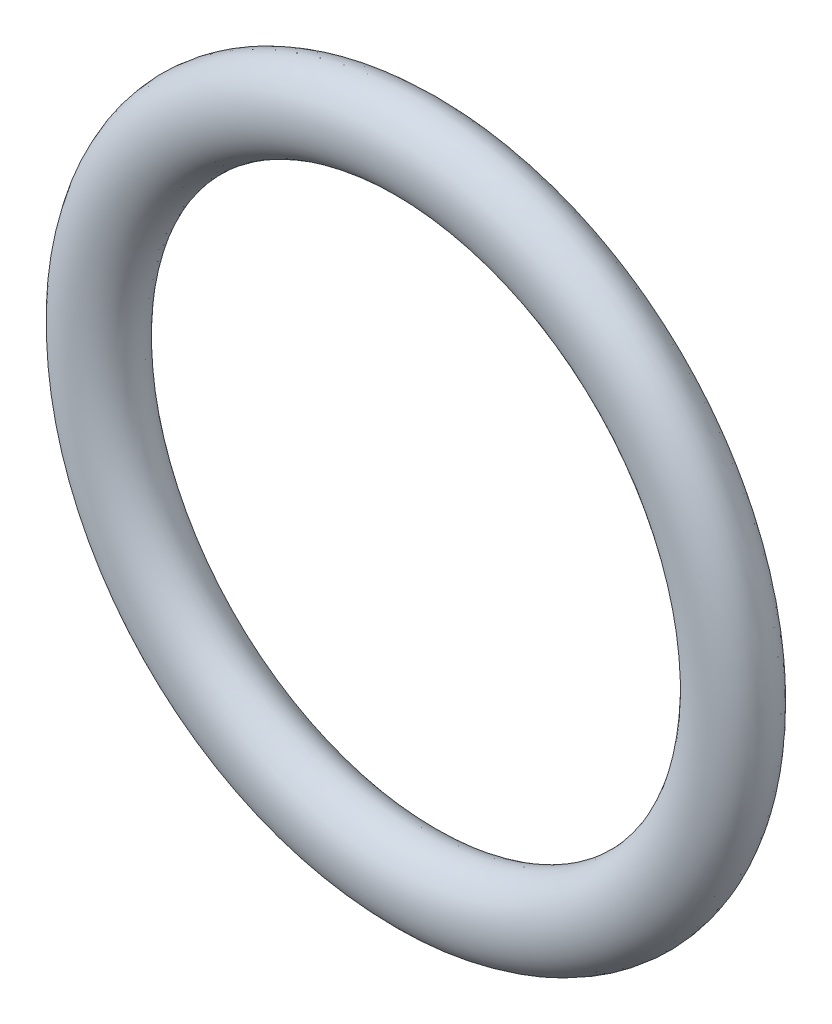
ISO-10303-21;
HEADER;
FILE_DESCRIPTION(('STEP AP214'),'2;1');
FILE_NAME('part.step','',(''),(''),'','','');
FILE_SCHEMA(('AUTOMOTIVE_DESIGN { 1 0 10303 214 1 1 1 1 }'));
ENDSEC;
DATA;
#1=APPLICATION_CONTEXT('core data for automotive mechanical design processes');
#2=APPLICATION_PROTOCOL_DEFINITION('international standard','automotive_design',2000,#1);
#3=PRODUCT_CONTEXT('',#1,'mechanical');
#4=PRODUCT('Part','Part','',(#3));
#5=PRODUCT_RELATED_PRODUCT_CATEGORY('part','',(#4));
#6=PRODUCT_DEFINITION_FORMATION('','',#4);
#7=PRODUCT_DEFINITION_CONTEXT('part definition',#1,'design');
#8=PRODUCT_DEFINITION('design','',#6,#7);
#9=PRODUCT_DEFINITION_SHAPE('','',#8);
#10=(LENGTH_UNIT() NAMED_UNIT(*) SI_UNIT(.MILLI.,.METRE.));
#11=(NAMED_UNIT(*) PLANE_ANGLE_UNIT() SI_UNIT($,.RADIAN.));
#12=(NAMED_UNIT(*) SI_UNIT($,.STERADIAN.) SOLID_ANGLE_UNIT());
#13=UNCERTAINTY_MEASURE_WITH_UNIT(LENGTH_MEASURE(1.E-05),#10,'distance_accuracy_value','');
#14=(GEOMETRIC_REPRESENTATION_CONTEXT(3) GLOBAL_UNCERTAINTY_ASSIGNED_CONTEXT((#13)) GLOBAL_UNIT_ASSIGNED_CONTEXT((#10,
#11,#12)) REPRESENTATION_CONTEXT('',''));
#15=CARTESIAN_POINT('',(0.,0.,0.));
#16=DIRECTION('',(0.,0.,1.));
#17=DIRECTION('',(1.,0.,0.));
#18=AXIS2_PLACEMENT_3D('',#15,#16,#17);
#19=CARTESIAN_POINT('',(0.,9.2,-0.950000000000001));
#20=DIRECTION('',(1.,0.,0.));
#21=DIRECTION('',(0.,1.,0.));
#22=AXIS2_PLACEMENT_3D('',#19,#20,#21);
#23=ELLIPSE('',#22,1.2,0.95);
#24=CARTESIAN_POINT('',(0.,0.,0.));
#25=DIRECTION('',(0.,0.,1.));
#26=AXIS1_PLACEMENT('',#24,#25);
#27=SURFACE_OF_REVOLUTION('',#23,#26);
#28=ADVANCED_FACE('F28',(),#27,.T.);
#29=CLOSED_SHELL('',(#28));
#30=MANIFOLD_SOLID_BREP('B2',#29);
#31=ADVANCED_BREP_SHAPE_REPRESENTATION('',(#18,#30),#14);
#32=SHAPE_DEFINITION_REPRESENTATION(#9,#31);
ENDSEC;
END-ISO-10303-21;
